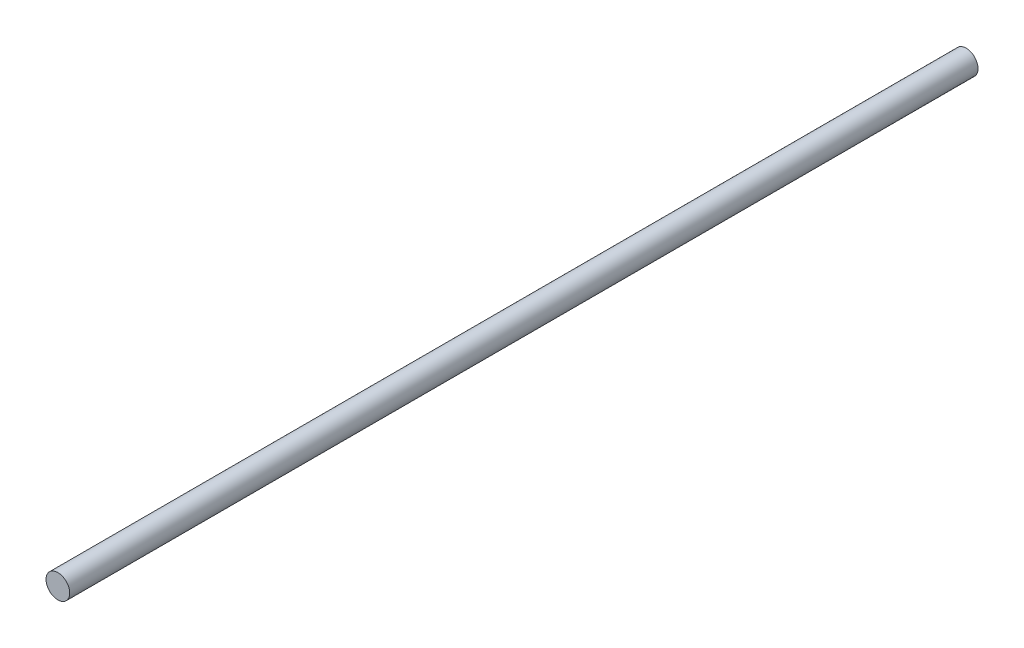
ISO-10303-21;
HEADER;
FILE_DESCRIPTION(('STEP AP214'),'2;1');
FILE_NAME('part.step','',(''),(''),'','','');
FILE_SCHEMA(('AUTOMOTIVE_DESIGN { 1 0 10303 214 1 1 1 1 }'));
ENDSEC;
DATA;
#1=APPLICATION_CONTEXT('core data for automotive mechanical design processes');
#2=APPLICATION_PROTOCOL_DEFINITION('international standard','automotive_design',2000,#1);
#3=PRODUCT_CONTEXT('',#1,'mechanical');
#4=PRODUCT('Part','Part','',(#3));
#5=PRODUCT_RELATED_PRODUCT_CATEGORY('part','',(#4));
#6=PRODUCT_DEFINITION_FORMATION('','',#4);
#7=PRODUCT_DEFINITION_CONTEXT('part definition',#1,'design');
#8=PRODUCT_DEFINITION('design','',#6,#7);
#9=PRODUCT_DEFINITION_SHAPE('','',#8);
#10=(LENGTH_UNIT() NAMED_UNIT(*) SI_UNIT(.MILLI.,.METRE.));
#11=(NAMED_UNIT(*) PLANE_ANGLE_UNIT() SI_UNIT($,.RADIAN.));
#12=(NAMED_UNIT(*) SI_UNIT($,.STERADIAN.) SOLID_ANGLE_UNIT());
#13=UNCERTAINTY_MEASURE_WITH_UNIT(LENGTH_MEASURE(1.E-05),#10,'distance_accuracy_value','');
#14=(GEOMETRIC_REPRESENTATION_CONTEXT(3) GLOBAL_UNCERTAINTY_ASSIGNED_CONTEXT((#13)) GLOBAL_UNIT_ASSIGNED_CONTEXT((#10,
#11,#12)) REPRESENTATION_CONTEXT('',''));
#15=CARTESIAN_POINT('',(0.,0.,0.));
#16=DIRECTION('',(0.,0.,1.));
#17=DIRECTION('',(1.,0.,0.));
#18=AXIS2_PLACEMENT_3D('',#15,#16,#17);
#19=CARTESIAN_POINT('',(0.,0.,58.42));
#20=DIRECTION('',(0.,0.,-1.));
#21=DIRECTION('',(-1.,0.,0.));
#22=AXIS2_PLACEMENT_3D('',#19,#20,#21);
#23=CYLINDRICAL_SURFACE('',#22,0.761999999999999);
#24=CARTESIAN_POINT('',(0.,0.,58.42));
#25=DIRECTION('',(0.,0.,1.));
#26=DIRECTION('',(1.,0.,0.));
#27=AXIS2_PLACEMENT_3D('',#24,#25,#26);
#28=CIRCLE('',#27,0.761999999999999);
#29=CARTESIAN_POINT('',(-0.761999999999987,0.,58.42));
#30=VERTEX_POINT('',#29);
#31=EDGE_CURVE('E10',#30,#30,#28,.T.);
#32=CARTESIAN_POINT('',(0.,0.,0.));
#33=DIRECTION('',(0.,0.,1.));
#34=DIRECTION('',(1.,0.,0.));
#35=AXIS2_PLACEMENT_3D('',#32,#33,#34);
#36=CIRCLE('',#35,0.761999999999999);
#37=CARTESIAN_POINT('',(-0.761999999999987,0.,0.));
#38=VERTEX_POINT('',#37);
#39=EDGE_CURVE('E37',#38,#38,#36,.T.);
#40=CARTESIAN_POINT('',(-0.761999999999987,0.,58.42));
#41=CARTESIAN_POINT('',(-0.761999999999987,0.,57.8114583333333));
#42=CARTESIAN_POINT('',(-0.761999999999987,0.,57.2029166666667));
#43=CARTESIAN_POINT('',(-0.761999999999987,0.,55.9858333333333));
#44=CARTESIAN_POINT('',(-0.761999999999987,0.,55.3772916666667));
#45=CARTESIAN_POINT('',(-0.761999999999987,0.,54.1602083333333));
#46=CARTESIAN_POINT('',(-0.761999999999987,0.,53.5516666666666));
#47=CARTESIAN_POINT('',(-0.761999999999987,0.,52.3345833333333));
#48=CARTESIAN_POINT('',(-0.761999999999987,0.,51.7260416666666));
#49=CARTESIAN_POINT('',(-0.761999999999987,0.,50.5089583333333));
#50=CARTESIAN_POINT('',(-0.761999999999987,0.,49.9004166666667));
#51=CARTESIAN_POINT('',(-0.761999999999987,0.,48.6833333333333));
#52=CARTESIAN_POINT('',(-0.761999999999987,0.,48.0747916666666));
#53=CARTESIAN_POINT('',(-0.761999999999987,0.,46.8577083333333));
#54=CARTESIAN_POINT('',(-0.761999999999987,0.,46.2491666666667));
#55=CARTESIAN_POINT('',(-0.761999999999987,0.,45.0320833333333));
#56=CARTESIAN_POINT('',(-0.761999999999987,0.,44.4235416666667));
#57=CARTESIAN_POINT('',(-0.761999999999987,0.,43.2064583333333));
#58=CARTESIAN_POINT('',(-0.761999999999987,0.,42.5979166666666));
#59=CARTESIAN_POINT('',(-0.761999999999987,0.,41.3808333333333));
#60=CARTESIAN_POINT('',(-0.761999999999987,0.,40.7722916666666));
#61=CARTESIAN_POINT('',(-0.761999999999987,0.,39.5552083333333));
#62=CARTESIAN_POINT('',(-0.761999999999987,0.,38.9466666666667));
#63=CARTESIAN_POINT('',(-0.761999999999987,0.,37.7295833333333));
#64=CARTESIAN_POINT('',(-0.761999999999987,0.,37.1210416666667));
#65=CARTESIAN_POINT('',(-0.761999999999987,0.,35.9039583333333));
#66=CARTESIAN_POINT('',(-0.761999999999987,0.,35.2954166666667));
#67=CARTESIAN_POINT('',(-0.761999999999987,0.,34.0783333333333));
#68=CARTESIAN_POINT('',(-0.761999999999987,0.,33.4697916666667));
#69=CARTESIAN_POINT('',(-0.761999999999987,0.,32.2527083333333));
#70=CARTESIAN_POINT('',(-0.761999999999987,0.,31.6441666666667));
#71=CARTESIAN_POINT('',(-0.761999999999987,0.,30.4270833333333));
#72=CARTESIAN_POINT('',(-0.761999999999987,0.,29.8185416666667));
#73=CARTESIAN_POINT('',(-0.761999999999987,0.,28.6014583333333));
#74=CARTESIAN_POINT('',(-0.761999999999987,0.,27.9929166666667));
#75=CARTESIAN_POINT('',(-0.761999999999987,0.,26.7758333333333));
#76=CARTESIAN_POINT('',(-0.761999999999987,0.,26.1672916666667));
#77=CARTESIAN_POINT('',(-0.761999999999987,0.,24.9502083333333));
#78=CARTESIAN_POINT('',(-0.761999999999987,0.,24.3416666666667));
#79=CARTESIAN_POINT('',(-0.761999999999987,0.,23.1245833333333));
#80=CARTESIAN_POINT('',(-0.761999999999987,0.,22.5160416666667));
#81=CARTESIAN_POINT('',(-0.761999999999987,0.,21.2989583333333));
#82=CARTESIAN_POINT('',(-0.761999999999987,0.,20.6904166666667));
#83=CARTESIAN_POINT('',(-0.761999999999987,0.,19.4733333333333));
#84=CARTESIAN_POINT('',(-0.761999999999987,0.,18.8647916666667));
#85=CARTESIAN_POINT('',(-0.761999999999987,0.,17.6477083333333));
#86=CARTESIAN_POINT('',(-0.761999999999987,0.,17.0391666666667));
#87=CARTESIAN_POINT('',(-0.761999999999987,0.,15.8220833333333));
#88=CARTESIAN_POINT('',(-0.761999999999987,0.,15.2135416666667));
#89=CARTESIAN_POINT('',(-0.761999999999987,0.,13.9964583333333));
#90=CARTESIAN_POINT('',(-0.761999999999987,0.,13.3879166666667));
#91=CARTESIAN_POINT('',(-0.761999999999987,0.,12.1708333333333));
#92=CARTESIAN_POINT('',(-0.761999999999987,0.,11.5622916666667));
#93=CARTESIAN_POINT('',(-0.761999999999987,0.,10.3452083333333));
#94=CARTESIAN_POINT('',(-0.761999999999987,0.,9.73666666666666));
#95=CARTESIAN_POINT('',(-0.761999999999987,0.,8.51958333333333));
#96=CARTESIAN_POINT('',(-0.761999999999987,0.,7.91104166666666));
#97=CARTESIAN_POINT('',(-0.761999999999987,0.,6.69395833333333));
#98=CARTESIAN_POINT('',(-0.761999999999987,0.,6.08541666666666));
#99=CARTESIAN_POINT('',(-0.761999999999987,0.,4.86833333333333));
#100=CARTESIAN_POINT('',(-0.761999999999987,0.,4.25979166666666));
#101=CARTESIAN_POINT('',(-0.761999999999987,0.,3.04270833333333));
#102=CARTESIAN_POINT('',(-0.761999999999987,0.,2.43416666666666));
#103=CARTESIAN_POINT('',(-0.761999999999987,0.,1.21708333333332));
#104=CARTESIAN_POINT('',(-0.761999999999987,0.,0.608541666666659));
#105=CARTESIAN_POINT('',(-0.761999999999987,0.,0.));
#106=B_SPLINE_CURVE_WITH_KNOTS('',3,(#40,#41,#42,#43,#44,#45,#46,#47,#48,#49,#50,#51,#52,#53,
#54,#55,#56,#57,#58,#59,#60,#61,#62,#63,#64,#65,#66,#67,#68,#69,#70,#71,#72,#73,#74,#75,#76,#77,
#78,#79,#80,#81,#82,#83,#84,#85,#86,#87,#88,#89,#90,#91,#92,#93,#94,#95,#96,#97,#98,#99,#100,
#101,#102,#103,#104,#105),.UNSPECIFIED.,.F.,.F.,(4,2,2,2,2,2,2,2,2,2,2,2,2,2,2,2,2,2,2,2,2,2,2,
2,2,2,2,2,2,2,2,2,4),(0.,1.825625,3.65125,5.47687500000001,7.3025,9.128125,10.95375,12.779375,
14.605,16.430625,18.25625,20.081875,21.9075,23.733125,25.55875,27.384375,29.21,31.035625,
32.86125,34.686875,36.5125,38.338125,40.16375,41.989375,43.815,45.640625,47.46625,49.291875,
51.1175,52.943125,54.76875,56.594375,58.42),.UNSPECIFIED.);
#107=EDGE_CURVE('BSEAM31',#30,#38,#106,.T.);
#108=ORIENTED_EDGE('',*,*,#31,.F.);
#109=ORIENTED_EDGE('',*,*,#39,.T.);
#110=ORIENTED_EDGE('',*,*,#107,.T.);
#111=ORIENTED_EDGE('',*,*,#107,.F.);
#112=EDGE_LOOP('',(#108,#110,#109,#111));
#113=FACE_BOUND('',#112,.T.);
#114=ADVANCED_FACE('F31',(#113),#23,.T.);
#115=CARTESIAN_POINT('',(0.,0.,58.42));
#116=DIRECTION('',(0.,0.,1.));
#117=DIRECTION('',(1.,0.,0.));
#118=AXIS2_PLACEMENT_3D('',#115,#116,#117);
#119=PLANE('',#118);
#120=ORIENTED_EDGE('',*,*,#31,.T.);
#121=EDGE_LOOP('',(#120));
#122=FACE_BOUND('',#121,.T.);
#123=ADVANCED_FACE('F46',(#122),#119,.T.);
#124=CARTESIAN_POINT('',(0.,0.,0.));
#125=DIRECTION('',(0.,0.,1.));
#126=DIRECTION('',(1.,0.,0.));
#127=AXIS2_PLACEMENT_3D('',#124,#125,#126);
#128=PLANE('',#127);
#129=ORIENTED_EDGE('',*,*,#39,.F.);
#130=EDGE_LOOP('',(#129));
#131=FACE_BOUND('',#130,.T.);
#132=ADVANCED_FACE('F44',(#131),#128,.F.);
#133=CLOSED_SHELL('',(#114,#123,#132));
#134=MANIFOLD_SOLID_BREP('B2',#133);
#135=ADVANCED_BREP_SHAPE_REPRESENTATION('',(#18,#134),#14);
#136=SHAPE_DEFINITION_REPRESENTATION(#9,#135);
ENDSEC;
END-ISO-10303-21;
